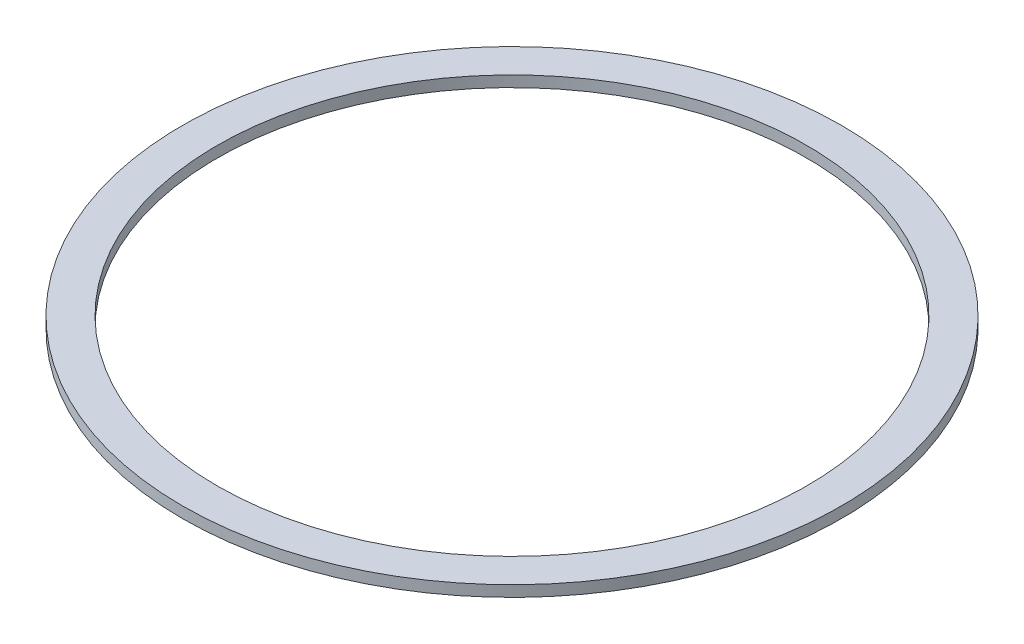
from build123d import *

# Parameters (mm, degrees)
SKETCH1_R           = 23.75
SKETCH1_R_2         = 21.25
BOSS_EXTRUDE1_DEPTH = 0.79375


with BuildPart() as part:
    # Sketch1 → Boss-Extrude1 (new body)
    with BuildSketch(Plane(origin=(0, 0, 0), x_dir=(1, 0, 0), z_dir=(0, 1, 0))):
        with Locations(Location((0, 0, 0), (0, 0, 270))):
            Circle(SKETCH1_R)
        with Locations(Location((0, 0, 0), (0, 0, 270))):
            Circle(SKETCH1_R_2, mode=Mode.SUBTRACT)
    extrude(amount=BOSS_EXTRUDE1_DEPTH)


solid = part.part
